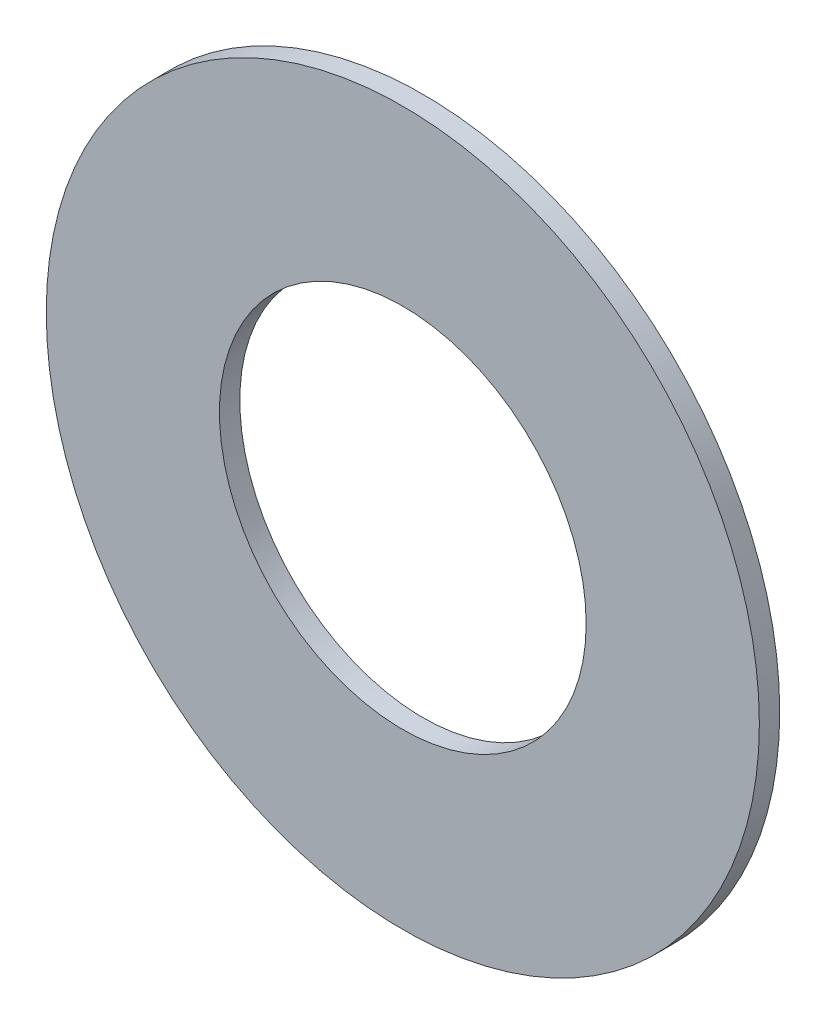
ISO-10303-21;
HEADER;
FILE_DESCRIPTION(('STEP AP214'),'2;1');
FILE_NAME('part.step','',(''),(''),'','','');
FILE_SCHEMA(('AUTOMOTIVE_DESIGN { 1 0 10303 214 1 1 1 1 }'));
ENDSEC;
DATA;
#1=APPLICATION_CONTEXT('core data for automotive mechanical design processes');
#2=APPLICATION_PROTOCOL_DEFINITION('international standard','automotive_design',2000,#1);
#3=PRODUCT_CONTEXT('',#1,'mechanical');
#4=PRODUCT('Part','Part','',(#3));
#5=PRODUCT_RELATED_PRODUCT_CATEGORY('part','',(#4));
#6=PRODUCT_DEFINITION_FORMATION('','',#4);
#7=PRODUCT_DEFINITION_CONTEXT('part definition',#1,'design');
#8=PRODUCT_DEFINITION('design','',#6,#7);
#9=PRODUCT_DEFINITION_SHAPE('','',#8);
#10=(LENGTH_UNIT() NAMED_UNIT(*) SI_UNIT(.MILLI.,.METRE.));
#11=(NAMED_UNIT(*) PLANE_ANGLE_UNIT() SI_UNIT($,.RADIAN.));
#12=(NAMED_UNIT(*) SI_UNIT($,.STERADIAN.) SOLID_ANGLE_UNIT());
#13=UNCERTAINTY_MEASURE_WITH_UNIT(LENGTH_MEASURE(1.E-05),#10,'distance_accuracy_value','');
#14=(GEOMETRIC_REPRESENTATION_CONTEXT(3) GLOBAL_UNCERTAINTY_ASSIGNED_CONTEXT((#13)) GLOBAL_UNIT_ASSIGNED_CONTEXT((#10,
#11,#12)) REPRESENTATION_CONTEXT('',''));
#15=CARTESIAN_POINT('',(0.,0.,0.));
#16=DIRECTION('',(0.,0.,1.));
#17=DIRECTION('',(1.,0.,0.));
#18=AXIS2_PLACEMENT_3D('',#15,#16,#17);
#19=CARTESIAN_POINT('',(0.,0.,2.));
#20=DIRECTION('',(0.,0.,1.));
#21=DIRECTION('',(1.,0.,0.));
#22=AXIS2_PLACEMENT_3D('',#19,#20,#21);
#23=PLANE('',#22);
#24=CARTESIAN_POINT('',(0.,0.,2.));
#25=DIRECTION('',(0.,0.,1.));
#26=DIRECTION('',(1.,0.,0.));
#27=AXIS2_PLACEMENT_3D('',#24,#25,#26);
#28=CIRCLE('',#27,35.);
#29=CARTESIAN_POINT('',(35.,0.,2.));
#30=VERTEX_POINT('',#29);
#31=EDGE_CURVE('E10',#30,#30,#28,.T.);
#32=ORIENTED_EDGE('',*,*,#31,.T.);
#33=EDGE_LOOP('',(#32));
#34=FACE_BOUND('',#33,.T.);
#35=CARTESIAN_POINT('',(0.,0.,2.));
#36=DIRECTION('',(0.,0.,1.));
#37=DIRECTION('',(1.,0.,0.));
#38=AXIS2_PLACEMENT_3D('',#35,#36,#37);
#39=CIRCLE('',#38,18.);
#40=CARTESIAN_POINT('',(18.,0.,2.));
#41=VERTEX_POINT('',#40);
#42=EDGE_CURVE('E43',#41,#41,#39,.T.);
#43=ORIENTED_EDGE('',*,*,#42,.F.);
#44=EDGE_LOOP('',(#43));
#45=FACE_BOUND('',#44,.T.);
#46=ADVANCED_FACE('F32',(#34,#45),#23,.T.);
#47=CARTESIAN_POINT('',(0.,0.,0.));
#48=DIRECTION('',(0.,0.,1.));
#49=DIRECTION('',(1.,0.,0.));
#50=AXIS2_PLACEMENT_3D('',#47,#48,#49);
#51=PLANE('',#50);
#52=CARTESIAN_POINT('',(0.,0.,0.));
#53=DIRECTION('',(0.,0.,1.));
#54=DIRECTION('',(1.,0.,0.));
#55=AXIS2_PLACEMENT_3D('',#52,#53,#54);
#56=CIRCLE('',#55,35.);
#57=CARTESIAN_POINT('',(35.,0.,0.));
#58=VERTEX_POINT('',#57);
#59=EDGE_CURVE('E36',#58,#58,#56,.T.);
#60=ORIENTED_EDGE('',*,*,#59,.F.);
#61=EDGE_LOOP('',(#60));
#62=FACE_BOUND('',#61,.T.);
#63=CARTESIAN_POINT('',(0.,0.,0.));
#64=DIRECTION('',(0.,0.,1.));
#65=DIRECTION('',(1.,0.,0.));
#66=AXIS2_PLACEMENT_3D('',#63,#64,#65);
#67=CIRCLE('',#66,18.);
#68=CARTESIAN_POINT('',(18.,0.,0.));
#69=VERTEX_POINT('',#68);
#70=EDGE_CURVE('E45',#69,#69,#67,.T.);
#71=ORIENTED_EDGE('',*,*,#70,.T.);
#72=EDGE_LOOP('',(#71));
#73=FACE_BOUND('',#72,.T.);
#74=ADVANCED_FACE('F55',(#62,#73),#51,.F.);
#75=CARTESIAN_POINT('',(0.,0.,2.));
#76=DIRECTION('',(0.,0.,-1.));
#77=DIRECTION('',(-1.,0.,0.));
#78=AXIS2_PLACEMENT_3D('',#75,#76,#77);
#79=CYLINDRICAL_SURFACE('',#78,35.);
#80=ORIENTED_EDGE('',*,*,#31,.F.);
#81=EDGE_LOOP('',(#80));
#82=FACE_BOUND('',#81,.T.);
#83=ORIENTED_EDGE('',*,*,#59,.T.);
#84=EDGE_LOOP('',(#83));
#85=FACE_BOUND('',#84,.T.);
#86=ADVANCED_FACE('F34',(#82,#85),#79,.T.);
#87=CARTESIAN_POINT('',(0.,0.,2.));
#88=DIRECTION('',(0.,0.,-1.));
#89=DIRECTION('',(-1.,0.,0.));
#90=AXIS2_PLACEMENT_3D('',#87,#88,#89);
#91=CYLINDRICAL_SURFACE('',#90,18.);
#92=ORIENTED_EDGE('',*,*,#42,.T.);
#93=EDGE_LOOP('',(#92));
#94=FACE_BOUND('',#93,.T.);
#95=ORIENTED_EDGE('',*,*,#70,.F.);
#96=EDGE_LOOP('',(#95));
#97=FACE_BOUND('',#96,.T.);
#98=ADVANCED_FACE('F51',(#94,#97),#91,.F.);
#99=CLOSED_SHELL('',(#46,#74,#86,#98));
#100=MANIFOLD_SOLID_BREP('B2',#99);
#101=ADVANCED_BREP_SHAPE_REPRESENTATION('',(#18,#100),#14);
#102=SHAPE_DEFINITION_REPRESENTATION(#9,#101);
ENDSEC;
END-ISO-10303-21;
